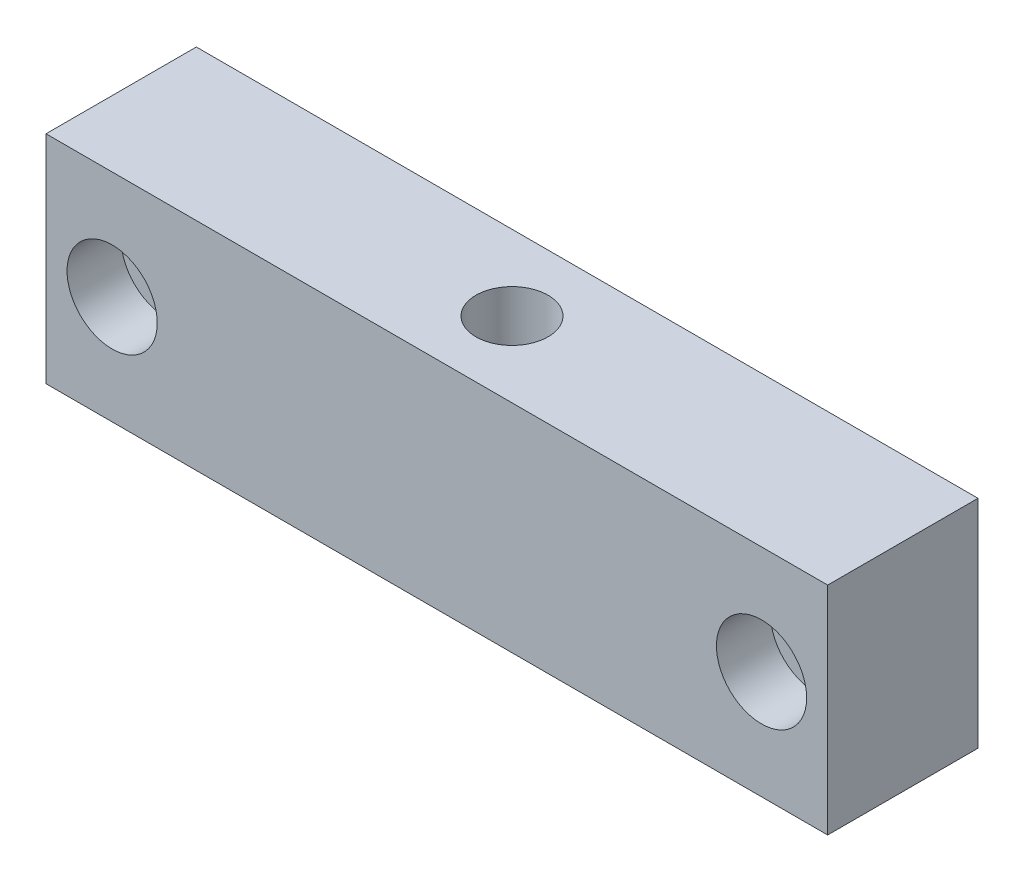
ISO-10303-21;
HEADER;
FILE_DESCRIPTION(('STEP AP214'),'2;1');
FILE_NAME('part.step','',(''),(''),'','','');
FILE_SCHEMA(('AUTOMOTIVE_DESIGN { 1 0 10303 214 1 1 1 1 }'));
ENDSEC;
DATA;
#1=APPLICATION_CONTEXT('core data for automotive mechanical design processes');
#2=APPLICATION_PROTOCOL_DEFINITION('international standard','automotive_design',2000,#1);
#3=PRODUCT_CONTEXT('',#1,'mechanical');
#4=PRODUCT('Part','Part','',(#3));
#5=PRODUCT_RELATED_PRODUCT_CATEGORY('part','',(#4));
#6=PRODUCT_DEFINITION_FORMATION('','',#4);
#7=PRODUCT_DEFINITION_CONTEXT('part definition',#1,'design');
#8=PRODUCT_DEFINITION('design','',#6,#7);
#9=PRODUCT_DEFINITION_SHAPE('','',#8);
#10=(LENGTH_UNIT() NAMED_UNIT(*) SI_UNIT(.MILLI.,.METRE.));
#11=(NAMED_UNIT(*) PLANE_ANGLE_UNIT() SI_UNIT($,.RADIAN.));
#12=(NAMED_UNIT(*) SI_UNIT($,.STERADIAN.) SOLID_ANGLE_UNIT());
#13=UNCERTAINTY_MEASURE_WITH_UNIT(LENGTH_MEASURE(1.E-05),#10,'distance_accuracy_value','');
#14=(GEOMETRIC_REPRESENTATION_CONTEXT(3) GLOBAL_UNCERTAINTY_ASSIGNED_CONTEXT((#13)) GLOBAL_UNIT_ASSIGNED_CONTEXT((#10,
#11,#12)) REPRESENTATION_CONTEXT('',''));
#15=CARTESIAN_POINT('',(0.,0.,0.));
#16=DIRECTION('',(0.,0.,1.));
#17=DIRECTION('',(1.,0.,0.));
#18=AXIS2_PLACEMENT_3D('',#15,#16,#17);
#19=CARTESIAN_POINT('',(119.,18.,20.5));
#20=DIRECTION('',(0.,0.,1.));
#21=DIRECTION('',(1.,0.,0.));
#22=AXIS2_PLACEMENT_3D('',#19,#20,#21);
#23=CYLINDRICAL_SURFACE('',#22,7.5);
#24=CARTESIAN_POINT('',(119.,18.,25.));
#25=DIRECTION('',(0.,0.,1.));
#26=DIRECTION('',(1.,0.,0.));
#27=AXIS2_PLACEMENT_3D('',#24,#25,#26);
#28=CIRCLE('',#27,7.5);
#29=CARTESIAN_POINT('',(126.5,18.,25.));
#30=VERTEX_POINT('',#29);
#31=EDGE_CURVE('E101',#30,#30,#28,.F.);
#32=ORIENTED_EDGE('',*,*,#31,.F.);
#33=EDGE_LOOP('',(#32));
#34=FACE_BOUND('',#33,.T.);
#35=CARTESIAN_POINT('',(119.,18.,16.));
#36=DIRECTION('',(0.,0.,1.));
#37=DIRECTION('',(1.,0.,0.));
#38=AXIS2_PLACEMENT_3D('',#35,#36,#37);
#39=CIRCLE('',#38,7.5);
#40=CARTESIAN_POINT('',(126.5,18.,16.));
#41=VERTEX_POINT('',#40);
#42=EDGE_CURVE('E99',#41,#41,#39,.T.);
#43=ORIENTED_EDGE('',*,*,#42,.F.);
#44=EDGE_LOOP('',(#43));
#45=FACE_BOUND('',#44,.T.);
#46=ADVANCED_FACE('F16',(#34,#45),#23,.F.);
#47=CARTESIAN_POINT('',(11.,18.,20.5));
#48=DIRECTION('',(0.,0.,1.));
#49=DIRECTION('',(1.,0.,0.));
#50=AXIS2_PLACEMENT_3D('',#47,#48,#49);
#51=CYLINDRICAL_SURFACE('',#50,7.5);
#52=CARTESIAN_POINT('',(11.,18.,25.));
#53=DIRECTION('',(0.,0.,1.));
#54=DIRECTION('',(1.,0.,0.));
#55=AXIS2_PLACEMENT_3D('',#52,#53,#54);
#56=CIRCLE('',#55,7.5);
#57=CARTESIAN_POINT('',(18.5,18.,25.));
#58=VERTEX_POINT('',#57);
#59=EDGE_CURVE('E19',#58,#58,#56,.F.);
#60=ORIENTED_EDGE('',*,*,#59,.F.);
#61=EDGE_LOOP('',(#60));
#62=FACE_BOUND('',#61,.T.);
#63=CARTESIAN_POINT('',(11.,18.,16.));
#64=DIRECTION('',(0.,0.,1.));
#65=DIRECTION('',(1.,0.,0.));
#66=AXIS2_PLACEMENT_3D('',#63,#64,#65);
#67=CIRCLE('',#66,7.5);
#68=CARTESIAN_POINT('',(18.5,18.,16.));
#69=VERTEX_POINT('',#68);
#70=EDGE_CURVE('E66',#69,#69,#67,.T.);
#71=ORIENTED_EDGE('',*,*,#70,.F.);
#72=EDGE_LOOP('',(#71));
#73=FACE_BOUND('',#72,.T.);
#74=ADVANCED_FACE('F109',(#62,#73),#51,.F.);
#75=CARTESIAN_POINT('',(65.,18.,12.5));
#76=DIRECTION('',(0.,1.,0.));
#77=DIRECTION('',(0.,0.,1.));
#78=AXIS2_PLACEMENT_3D('',#75,#76,#77);
#79=CYLINDRICAL_SURFACE('',#78,6.);
#80=CARTESIAN_POINT('',(65.,36.,12.5));
#81=DIRECTION('',(0.,1.,0.));
#82=DIRECTION('',(0.,0.,1.));
#83=AXIS2_PLACEMENT_3D('',#80,#81,#82);
#84=CIRCLE('',#83,6.);
#85=CARTESIAN_POINT('',(65.,36.,18.5));
#86=VERTEX_POINT('',#85);
#87=EDGE_CURVE('E93',#86,#86,#84,.F.);
#88=ORIENTED_EDGE('',*,*,#87,.F.);
#89=EDGE_LOOP('',(#88));
#90=FACE_BOUND('',#89,.T.);
#91=CARTESIAN_POINT('',(65.,0.,12.5));
#92=DIRECTION('',(0.,1.,0.));
#93=DIRECTION('',(0.,0.,1.));
#94=AXIS2_PLACEMENT_3D('',#91,#92,#93);
#95=CIRCLE('',#94,6.);
#96=CARTESIAN_POINT('',(65.,0.,18.5));
#97=VERTEX_POINT('',#96);
#98=EDGE_CURVE('E65',#97,#97,#95,.T.);
#99=ORIENTED_EDGE('',*,*,#98,.F.);
#100=EDGE_LOOP('',(#99));
#101=FACE_BOUND('',#100,.T.);
#102=ADVANCED_FACE('F112',(#90,#101),#79,.F.);
#103=CARTESIAN_POINT('',(0.,0.,25.));
#104=DIRECTION('',(0.,0.,1.));
#105=DIRECTION('',(1.,0.,0.));
#106=AXIS2_PLACEMENT_3D('',#103,#104,#105);
#107=PLANE('',#106);
#108=ORIENTED_EDGE('',*,*,#31,.T.);
#109=EDGE_LOOP('',(#108));
#110=FACE_BOUND('',#109,.T.);
#111=ORIENTED_EDGE('',*,*,#59,.T.);
#112=EDGE_LOOP('',(#111));
#113=FACE_BOUND('',#112,.T.);
#114=DIRECTION('',(1.,0.,0.));
#115=VECTOR('',#114,1.);
#116=CARTESIAN_POINT('',(130.,36.,25.));
#117=LINE('',#116,#115);
#118=CARTESIAN_POINT('',(0.,36.,25.));
#119=VERTEX_POINT('',#118);
#120=CARTESIAN_POINT('',(130.,36.,25.));
#121=VERTEX_POINT('',#120);
#122=EDGE_CURVE('E95',#119,#121,#117,.T.);
#123=ORIENTED_EDGE('',*,*,#122,.F.);
#124=DIRECTION('',(0.,1.,0.));
#125=VECTOR('',#124,1.);
#126=CARTESIAN_POINT('',(0.,36.,25.));
#127=LINE('',#126,#125);
#128=CARTESIAN_POINT('',(0.,0.,25.));
#129=VERTEX_POINT('',#128);
#130=EDGE_CURVE('E60',#129,#119,#127,.T.);
#131=ORIENTED_EDGE('',*,*,#130,.F.);
#132=DIRECTION('',(1.,0.,0.));
#133=VECTOR('',#132,1.);
#134=CARTESIAN_POINT('',(0.,0.,25.));
#135=LINE('',#134,#133);
#136=CARTESIAN_POINT('',(130.,0.,25.));
#137=VERTEX_POINT('',#136);
#138=EDGE_CURVE('E58',#137,#129,#135,.F.);
#139=ORIENTED_EDGE('',*,*,#138,.F.);
#140=DIRECTION('',(0.,1.,0.));
#141=VECTOR('',#140,1.);
#142=CARTESIAN_POINT('',(130.,0.,25.));
#143=LINE('',#142,#141);
#144=EDGE_CURVE('E55',#121,#137,#143,.F.);
#145=ORIENTED_EDGE('',*,*,#144,.F.);
#146=EDGE_LOOP('',(#123,#131,#139,#145));
#147=FACE_BOUND('',#146,.T.);
#148=ADVANCED_FACE('F59',(#110,#113,#147),#107,.T.);
#149=CARTESIAN_POINT('',(0.,0.,16.));
#150=DIRECTION('',(0.,0.,1.));
#151=DIRECTION('',(1.,0.,0.));
#152=AXIS2_PLACEMENT_3D('',#149,#150,#151);
#153=PLANE('',#152);
#154=CARTESIAN_POINT('',(119.,18.,16.));
#155=DIRECTION('',(0.,0.,1.));
#156=DIRECTION('',(1.,0.,0.));
#157=AXIS2_PLACEMENT_3D('',#154,#155,#156);
#158=CIRCLE('',#157,3.5);
#159=CARTESIAN_POINT('',(122.5,18.,16.));
#160=VERTEX_POINT('',#159);
#161=EDGE_CURVE('E90',#160,#160,#158,.F.);
#162=ORIENTED_EDGE('',*,*,#161,.T.);
#163=EDGE_LOOP('',(#162));
#164=FACE_BOUND('',#163,.T.);
#165=ORIENTED_EDGE('',*,*,#42,.T.);
#166=EDGE_LOOP('',(#165));
#167=FACE_BOUND('',#166,.T.);
#168=ADVANCED_FACE('F117',(#164,#167),#153,.T.);
#169=CARTESIAN_POINT('',(0.,0.,16.));
#170=DIRECTION('',(0.,0.,1.));
#171=DIRECTION('',(1.,0.,0.));
#172=AXIS2_PLACEMENT_3D('',#169,#170,#171);
#173=PLANE('',#172);
#174=CARTESIAN_POINT('',(11.,18.,16.));
#175=DIRECTION('',(0.,0.,1.));
#176=DIRECTION('',(1.,0.,0.));
#177=AXIS2_PLACEMENT_3D('',#174,#175,#176);
#178=CIRCLE('',#177,3.5);
#179=CARTESIAN_POINT('',(14.5,18.,16.));
#180=VERTEX_POINT('',#179);
#181=EDGE_CURVE('E87',#180,#180,#178,.F.);
#182=ORIENTED_EDGE('',*,*,#181,.T.);
#183=EDGE_LOOP('',(#182));
#184=FACE_BOUND('',#183,.T.);
#185=ORIENTED_EDGE('',*,*,#70,.T.);
#186=EDGE_LOOP('',(#185));
#187=FACE_BOUND('',#186,.T.);
#188=ADVANCED_FACE('F115',(#184,#187),#173,.T.);
#189=CARTESIAN_POINT('',(0.,0.,0.));
#190=DIRECTION('',(0.,-1.,0.));
#191=DIRECTION('',(0.,0.,-1.));
#192=AXIS2_PLACEMENT_3D('',#189,#190,#191);
#193=PLANE('',#192);
#194=ORIENTED_EDGE('',*,*,#98,.T.);
#195=EDGE_LOOP('',(#194));
#196=FACE_BOUND('',#195,.T.);
#197=DIRECTION('',(0.,0.,-1.));
#198=VECTOR('',#197,1.);
#199=CARTESIAN_POINT('',(130.,0.,0.));
#200=LINE('',#199,#198);
#201=CARTESIAN_POINT('',(130.,0.,0.));
#202=VERTEX_POINT('',#201);
#203=EDGE_CURVE('E72',#137,#202,#200,.T.);
#204=ORIENTED_EDGE('',*,*,#203,.F.);
#205=ORIENTED_EDGE('',*,*,#138,.T.);
#206=DIRECTION('',(0.,0.,1.));
#207=VECTOR('',#206,1.);
#208=CARTESIAN_POINT('',(0.,0.,0.));
#209=LINE('',#208,#207);
#210=CARTESIAN_POINT('',(0.,0.,0.));
#211=VERTEX_POINT('',#210);
#212=EDGE_CURVE('E224',#211,#129,#209,.T.);
#213=ORIENTED_EDGE('',*,*,#212,.F.);
#214=DIRECTION('',(1.,0.,0.));
#215=VECTOR('',#214,1.);
#216=CARTESIAN_POINT('',(0.,0.,0.));
#217=LINE('',#216,#215);
#218=EDGE_CURVE('E78',#211,#202,#217,.T.);
#219=ORIENTED_EDGE('',*,*,#218,.T.);
#220=EDGE_LOOP('',(#204,#205,#213,#219));
#221=FACE_BOUND('',#220,.T.);
#222=ADVANCED_FACE('F77',(#196,#221),#193,.T.);
#223=CARTESIAN_POINT('',(130.,0.,0.));
#224=DIRECTION('',(1.,0.,0.));
#225=DIRECTION('',(0.,0.,-1.));
#226=AXIS2_PLACEMENT_3D('',#223,#224,#225);
#227=PLANE('',#226);
#228=DIRECTION('',(0.,0.,1.));
#229=VECTOR('',#228,1.);
#230=CARTESIAN_POINT('',(130.,36.,0.));
#231=LINE('',#230,#229);
#232=CARTESIAN_POINT('',(130.,36.,0.));
#233=VERTEX_POINT('',#232);
#234=EDGE_CURVE('E74',#121,#233,#231,.F.);
#235=ORIENTED_EDGE('',*,*,#234,.F.);
#236=ORIENTED_EDGE('',*,*,#144,.T.);
#237=ORIENTED_EDGE('',*,*,#203,.T.);
#238=DIRECTION('',(0.,1.,0.));
#239=VECTOR('',#238,1.);
#240=CARTESIAN_POINT('',(130.,0.,0.));
#241=LINE('',#240,#239);
#242=EDGE_CURVE('E230',#202,#233,#241,.T.);
#243=ORIENTED_EDGE('',*,*,#242,.T.);
#244=EDGE_LOOP('',(#235,#236,#237,#243));
#245=FACE_BOUND('',#244,.T.);
#246=ADVANCED_FACE('F70',(#245),#227,.T.);
#247=CARTESIAN_POINT('',(130.,36.,0.));
#248=DIRECTION('',(0.,1.,0.));
#249=DIRECTION('',(0.,0.,1.));
#250=AXIS2_PLACEMENT_3D('',#247,#248,#249);
#251=PLANE('',#250);
#252=ORIENTED_EDGE('',*,*,#87,.T.);
#253=EDGE_LOOP('',(#252));
#254=FACE_BOUND('',#253,.T.);
#255=DIRECTION('',(0.,0.,1.));
#256=VECTOR('',#255,1.);
#257=CARTESIAN_POINT('',(0.,36.,0.));
#258=LINE('',#257,#256);
#259=CARTESIAN_POINT('',(0.,36.,0.));
#260=VERTEX_POINT('',#259);
#261=EDGE_CURVE('E34',#119,#260,#258,.F.);
#262=ORIENTED_EDGE('',*,*,#261,.F.);
#263=ORIENTED_EDGE('',*,*,#122,.T.);
#264=ORIENTED_EDGE('',*,*,#234,.T.);
#265=DIRECTION('',(1.,0.,0.));
#266=VECTOR('',#265,1.);
#267=CARTESIAN_POINT('',(0.,36.,0.));
#268=LINE('',#267,#266);
#269=EDGE_CURVE('E223',#233,#260,#268,.F.);
#270=ORIENTED_EDGE('',*,*,#269,.T.);
#271=EDGE_LOOP('',(#262,#263,#264,#270));
#272=FACE_BOUND('',#271,.T.);
#273=ADVANCED_FACE('F149',(#254,#272),#251,.T.);
#274=CARTESIAN_POINT('',(0.,36.,0.));
#275=DIRECTION('',(-1.,0.,0.));
#276=DIRECTION('',(0.,0.,1.));
#277=AXIS2_PLACEMENT_3D('',#274,#275,#276);
#278=PLANE('',#277);
#279=ORIENTED_EDGE('',*,*,#212,.T.);
#280=ORIENTED_EDGE('',*,*,#130,.T.);
#281=ORIENTED_EDGE('',*,*,#261,.T.);
#282=DIRECTION('',(0.,1.,0.));
#283=VECTOR('',#282,1.);
#284=CARTESIAN_POINT('',(0.,0.,0.));
#285=LINE('',#284,#283);
#286=EDGE_CURVE('E86',#260,#211,#285,.F.);
#287=ORIENTED_EDGE('',*,*,#286,.T.);
#288=EDGE_LOOP('',(#279,#280,#281,#287));
#289=FACE_BOUND('',#288,.T.);
#290=ADVANCED_FACE('F145',(#289),#278,.T.);
#291=CARTESIAN_POINT('',(119.,18.,7.3399999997));
#292=DIRECTION('',(0.,0.,1.));
#293=DIRECTION('',(1.,0.,0.));
#294=AXIS2_PLACEMENT_3D('',#291,#292,#293);
#295=CYLINDRICAL_SURFACE('',#294,3.5);
#296=ORIENTED_EDGE('',*,*,#161,.F.);
#297=EDGE_LOOP('',(#296));
#298=FACE_BOUND('',#297,.T.);
#299=CARTESIAN_POINT('',(119.,18.,0.));
#300=DIRECTION('',(0.,0.,1.));
#301=DIRECTION('',(1.,0.,0.));
#302=AXIS2_PLACEMENT_3D('',#299,#300,#301);
#303=CIRCLE('',#302,3.5);
#304=CARTESIAN_POINT('',(122.5,18.,0.));
#305=VERTEX_POINT('',#304);
#306=EDGE_CURVE('E25',#305,#305,#303,.F.);
#307=ORIENTED_EDGE('',*,*,#306,.T.);
#308=EDGE_LOOP('',(#307));
#309=FACE_BOUND('',#308,.T.);
#310=ADVANCED_FACE('F137',(#298,#309),#295,.F.);
#311=CARTESIAN_POINT('',(11.,18.,7.3399999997));
#312=DIRECTION('',(0.,0.,1.));
#313=DIRECTION('',(1.,0.,0.));
#314=AXIS2_PLACEMENT_3D('',#311,#312,#313);
#315=CYLINDRICAL_SURFACE('',#314,3.5);
#316=ORIENTED_EDGE('',*,*,#181,.F.);
#317=EDGE_LOOP('',(#316));
#318=FACE_BOUND('',#317,.T.);
#319=CARTESIAN_POINT('',(11.,18.,0.));
#320=DIRECTION('',(0.,0.,1.));
#321=DIRECTION('',(1.,0.,0.));
#322=AXIS2_PLACEMENT_3D('',#319,#320,#321);
#323=CIRCLE('',#322,3.5);
#324=CARTESIAN_POINT('',(14.5,18.,0.));
#325=VERTEX_POINT('',#324);
#326=EDGE_CURVE('E10',#325,#325,#323,.F.);
#327=ORIENTED_EDGE('',*,*,#326,.T.);
#328=EDGE_LOOP('',(#327));
#329=FACE_BOUND('',#328,.T.);
#330=ADVANCED_FACE('F131',(#318,#329),#315,.F.);
#331=CARTESIAN_POINT('',(0.,0.,0.));
#332=DIRECTION('',(0.,0.,1.));
#333=DIRECTION('',(1.,0.,0.));
#334=AXIS2_PLACEMENT_3D('',#331,#332,#333);
#335=PLANE('',#334);
#336=ORIENTED_EDGE('',*,*,#326,.F.);
#337=EDGE_LOOP('',(#336));
#338=FACE_BOUND('',#337,.T.);
#339=ORIENTED_EDGE('',*,*,#306,.F.);
#340=EDGE_LOOP('',(#339));
#341=FACE_BOUND('',#340,.T.);
#342=ORIENTED_EDGE('',*,*,#269,.F.);
#343=ORIENTED_EDGE('',*,*,#242,.F.);
#344=ORIENTED_EDGE('',*,*,#218,.F.);
#345=ORIENTED_EDGE('',*,*,#286,.F.);
#346=EDGE_LOOP('',(#342,#343,#344,#345));
#347=FACE_BOUND('',#346,.T.);
#348=ADVANCED_FACE('F129',(#338,#341,#347),#335,.F.);
#349=CLOSED_SHELL('',(#46,#74,#102,#148,#168,#188,#222,#246,#273,#290,#310,#330,#348));
#350=MANIFOLD_SOLID_BREP('B1',#349);
#351=ADVANCED_BREP_SHAPE_REPRESENTATION('',(#18,#350),#14);
#352=SHAPE_DEFINITION_REPRESENTATION(#9,#351);
ENDSEC;
END-ISO-10303-21;
